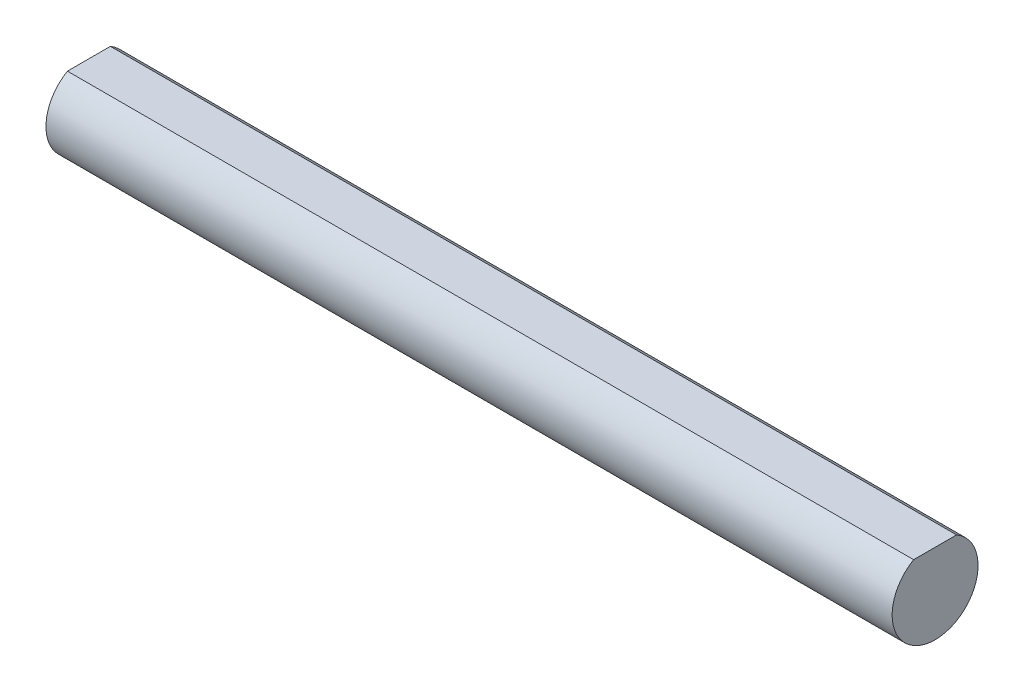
from build123d import *

# Parameters (mm, degrees)
BOSS_EXTRUDE1_DEPTH = 59.1


with BuildPart() as part:
    # Sketch1 → Boss-Extrude1 (new body)
    with BuildSketch(Plane(origin=(0, 0, 0), x_dir=(0, 0, -1), z_dir=(1, 0, 0))):
        with BuildLine():
            Line((1.5, 2.598076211), (-1.5, 2.598076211))
            ThreePointArc((-1.5, 2.598076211), (0, -3), (1.5, 2.598076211))
        make_face()
    extrude(amount=BOSS_EXTRUDE1_DEPTH)


solid = part.part
